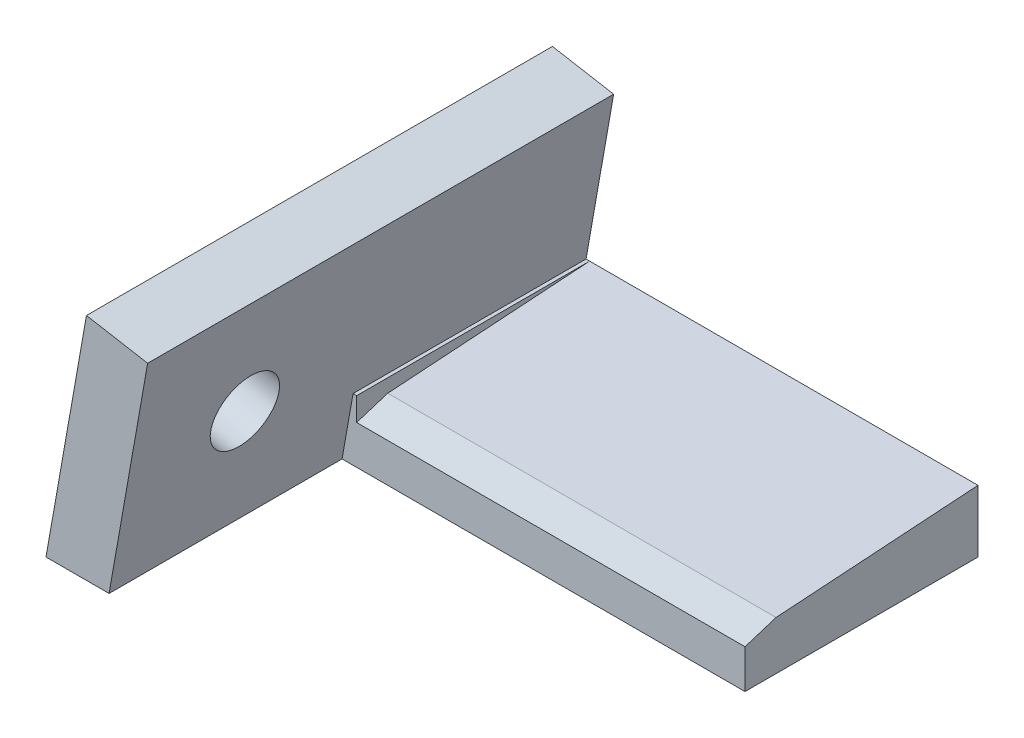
from build123d import *

# Parameters (mm, degrees)
EXTRUDE_1_DEPTH     = 15
EXTRUDE_2_DEPTH     = 15
CUT_EXTRUDE_4_DEPTH = 25
SKETCH_4_R          = 2.2
CUT_EXTRUDE_5_DEPTH = 5
CUT_EXTRUDE_6_DEPTH = 25


with BuildPart() as part:
    # Sketch 1 → Extrude 1 (new body)
    with BuildSketch(Plane.XY):
        Polygon((0, -4), (30, -4), (30, 0), (4.76701437, 0), (6.543953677, 10.077523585), (2.604722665, 10.772116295), align=None)
    extrude(amount=EXTRUDE_1_DEPTH)

    # Sketch 2 → Extrude 2 (add)
    with BuildSketch(Plane.XY.offset(15)):
        Polygon((2.604722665, 10.772116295), (6.543953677, 10.077523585), (4.061706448, -4), (0, -4), align=None)
    extrude(amount=EXTRUDE_2_DEPTH)

    # Sketch 3 → Cut-Extrude 4 (cut)
    with BuildSketch(Plane(origin=(30, 0, 0), x_dir=(0, 0, -1), z_dir=(1, 0, 0))):
        Polygon((0, 0), (-15, -1), (-15, 0), align=None)
    extrude(amount=-CUT_EXTRUDE_4_DEPTH, mode=Mode.SUBTRACT)

    # Sketch 4 → Cut-Extrude 5 (cut)
    with BuildSketch(Plane(origin=(4.623271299, -0.815207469, 0), x_dir=(0, 0, -1), z_dir=(0.9848077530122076, -0.17364817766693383, 0))):
        with Locations(Location((-22.5, 3.913422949, 0), (0, 0, 90))):
            Circle(SKETCH_4_R)
    extrude(amount=-CUT_EXTRUDE_5_DEPTH, mode=Mode.SUBTRACT)

    # Sketch 5 → Cut-Extrude 6 (cut)
    with BuildSketch(Plane(origin=(30, 0, 0), x_dir=(0, 0, -1), z_dir=(1, 0, 0))):
        Polygon((-15, -1), (-13, -0.866666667), (-15, -1.5), align=None)
    extrude(amount=-CUT_EXTRUDE_6_DEPTH, mode=Mode.SUBTRACT)


solid = part.part
